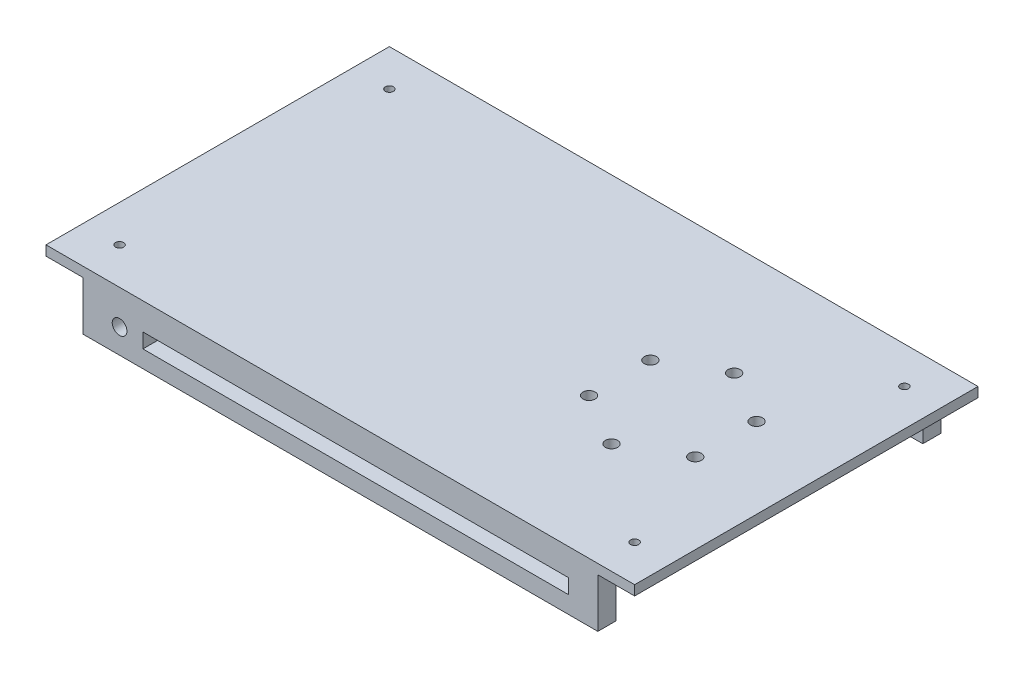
from build123d import *

# Parameters (mm, degrees)
SKETCH_1_W                            = 480
SKETCH_1_H                            = 8
PAYLOAD_DECK_480X280X8_DEPTH          = 140
SKETCH_2_W                            = 420
SKETCH_2_H                            = 40
GUIDE_RAILS_BLANK_DEPTH               = 140
SKETCH_3_W                            = 430
SKETCH_3_H                            = 42
OPEN_CENTRE_UNDER_DECK_DEPTH          = 125
SKETCH_4_R                            = 6
FIXED_PIVOT_D12_XMINUS180_DEPTH       = 500
SKETCH_5_W                            = 347
SKETCH_5_H                            = 12
SLIDING_GUIDE_12X347_DEPTH            = 500
SKETCH_6_R                            = 3.3
FOUR_M6_CLEARANCE_D6P6_420X220_DEPTH  = 50
SKETCH_7_R                            = 5
MATCH_ORIGINAL_ARM_FLANGE_HOLES_DEPTH = 50
SKETCH_8_R                            = 5
COMPLETE_ORIGINAL_6XD10_FLANGE_DEPTH  = 50


with BuildPart() as part:
    # Sketch 1 → Payload_Deck_480x280x8 (new, symmetric)
    with BuildSketch(Plane.XY):
        with Locations((0, 4)):
            Rectangle(SKETCH_1_W, SKETCH_1_H)
    extrude(amount=PAYLOAD_DECK_480X280X8_DEPTH, both=True)

    # Sketch 2 → Guide_Rails_Blank (add, symmetric)
    with BuildSketch(Plane.XY):
        with Locations((0, -20)):
            Rectangle(SKETCH_2_W, SKETCH_2_H)
    extrude(amount=GUIDE_RAILS_BLANK_DEPTH, both=True)

    # Sketch 3 → Open_Centre_Under_Deck (cut, symmetric)
    with BuildSketch(Plane.XY):
        with Locations((0, -21)):
            Rectangle(SKETCH_3_W, SKETCH_3_H)
    extrude(amount=OPEN_CENTRE_UNDER_DECK_DEPTH, both=True, mode=Mode.SUBTRACT)

    # Sketch 4 → Fixed_Pivot_D12_Xminus180 (cut, symmetric)
    with BuildSketch(Plane.XY):
        with Locations(Location((-180, -20, 0), (0, 0, 180))):
            Circle(SKETCH_4_R)
    extrude(amount=FIXED_PIVOT_D12_XMINUS180_DEPTH, both=True, mode=Mode.SUBTRACT)

    # Sketch 5 → Sliding_Guide_12x347 (cut, symmetric)
    with BuildSketch(Plane.XY):
        with Locations((12.5, -20)):
            Rectangle(SKETCH_5_W, SKETCH_5_H)
    extrude(amount=SLIDING_GUIDE_12X347_DEPTH, both=True, mode=Mode.SUBTRACT)

    # Sketch 6 → Four_M6_Clearance_D6p6_420x220 (cut, symmetric)
    with BuildSketch(Plane(origin=(0, 0, 0), x_dir=(1, 0, 0), z_dir=(0, 1, 0))):
        with Locations(Location((-210, -110, 0), (0, 0, 270))):
            Circle(SKETCH_6_R)
        with Locations(Location((-210, 110, 0), (0, 0, 270))):
            Circle(SKETCH_6_R)
        with Locations(Location((210, -110, 0), (0, 0, 270))):
            Circle(SKETCH_6_R)
        with Locations(Location((210, 110, 0), (0, 0, 270))):
            Circle(SKETCH_6_R)
    extrude(amount=FOUR_M6_CLEARANCE_D6P6_420X220_DEPTH, both=True, mode=Mode.SUBTRACT)

    # Sketch 7 → Match_Original_Arm_Flange_Holes (cut, symmetric)
    with BuildSketch(Plane(origin=(0, 0, 0), x_dir=(1, 0, 0), z_dir=(0, 1, 0))):
        with Locations(Location((174.447593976, -25, 0), (0, 0, 270))):
            Circle(SKETCH_7_R)
        with Locations(Location((131.146323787, 50, 0), (0, 0, 270))):
            Circle(SKETCH_7_R)
        with Locations(Location((87.845053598, 25, 0), (0, 0, 270))):
            Circle(SKETCH_7_R)
        with Locations(Location((87.845053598, -25, 0), (0, 0, 270))):
            Circle(SKETCH_7_R)
    extrude(amount=MATCH_ORIGINAL_ARM_FLANGE_HOLES_DEPTH, both=True, mode=Mode.SUBTRACT)

    # Sketch 8 → Complete_Original_6xD10_Flange (cut, symmetric)
    with BuildSketch(Plane(origin=(0, 0, 0), x_dir=(1, 0, 0), z_dir=(0, 1, 0))):
        with Locations(Location((174.447593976, 25, 0), (0, 0, 270))):
            Circle(SKETCH_8_R)
        with Locations(Location((131.146323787, -50, 0), (0, 0, 270))):
            Circle(SKETCH_8_R)
    extrude(amount=COMPLETE_ORIGINAL_6XD10_FLANGE_DEPTH, both=True, mode=Mode.SUBTRACT)


solid = part.part
